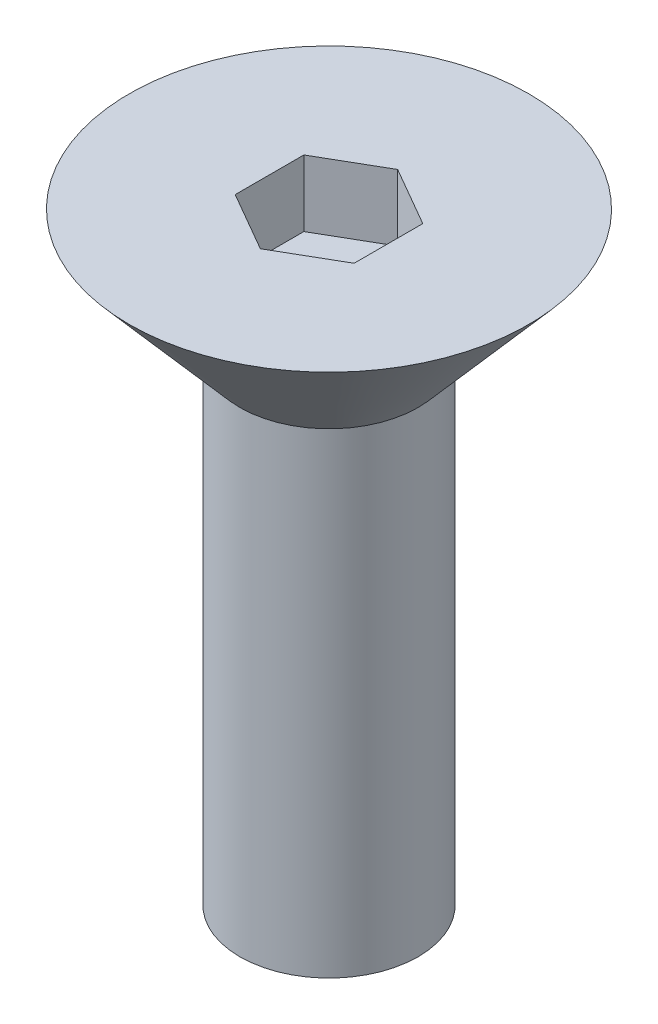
from build123d import *

# Parameters (mm, degrees)
HEXCUT_DEPTH = 1.116


with BuildPart() as part:
    # Sketch1 → Screw (revolve)
    with BuildSketch(Plane.XY, mode=Mode.PRIVATE) as screw_sk:
        Polygon((0, 0), (3.36, 0), (1.5, -2.139685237), (1.5, -10.139685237), (0, -10.139685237), align=None)
    revolve(screw_sk.sketch.rotate(Axis((0, 25.4, 0), (0, -1, 0)), 90), axis=Axis((0, 25.4, 0), (0, -1, 0)))

    # Sketch2 → HexCut (cut)
    with BuildSketch(Plane(origin=(0, 0, 0), x_dir=(-1, 0, 0), z_dir=(0, 1, 0))):
        Polygon((-1, -0.577350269), (-1, 0.577350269), (0, 1.154700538), (1, 0.577350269), (1, -0.577350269), (0, -1.154700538), align=None)
    extrude(amount=-HEXCUT_DEPTH, mode=Mode.SUBTRACT)


solid = part.part
